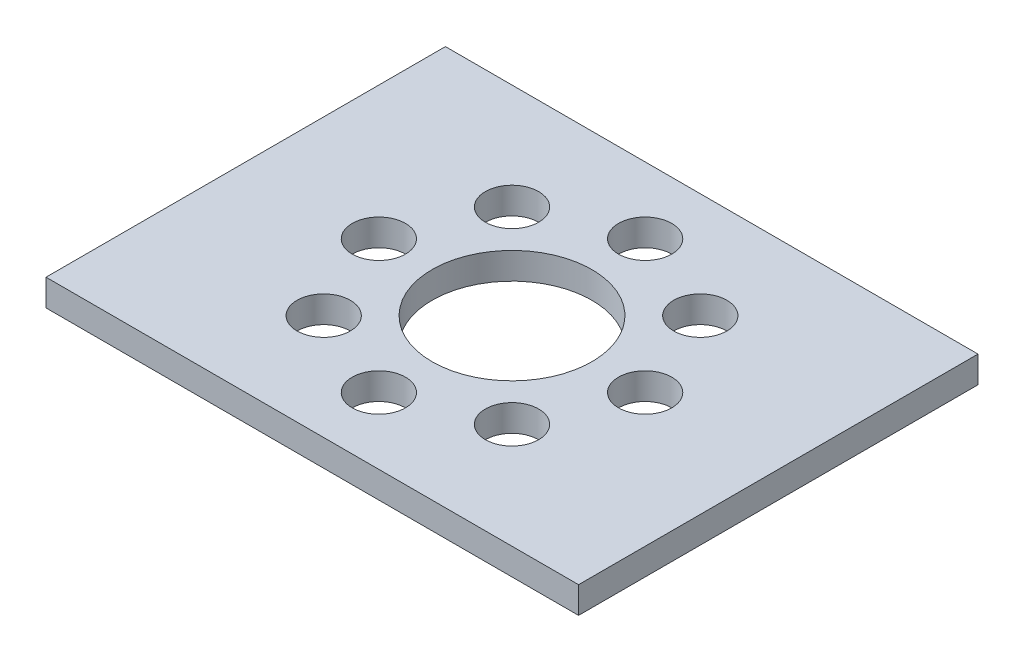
ISO-10303-21;
HEADER;
FILE_DESCRIPTION(('STEP AP214'),'2;1');
FILE_NAME('part.step','',(''),(''),'','','');
FILE_SCHEMA(('AUTOMOTIVE_DESIGN { 1 0 10303 214 1 1 1 1 }'));
ENDSEC;
DATA;
#1=APPLICATION_CONTEXT('core data for automotive mechanical design processes');
#2=APPLICATION_PROTOCOL_DEFINITION('international standard','automotive_design',2000,#1);
#3=PRODUCT_CONTEXT('',#1,'mechanical');
#4=PRODUCT('Part','Part','',(#3));
#5=PRODUCT_RELATED_PRODUCT_CATEGORY('part','',(#4));
#6=PRODUCT_DEFINITION_FORMATION('','',#4);
#7=PRODUCT_DEFINITION_CONTEXT('part definition',#1,'design');
#8=PRODUCT_DEFINITION('design','',#6,#7);
#9=PRODUCT_DEFINITION_SHAPE('','',#8);
#10=(LENGTH_UNIT() NAMED_UNIT(*) SI_UNIT(.MILLI.,.METRE.));
#11=(NAMED_UNIT(*) PLANE_ANGLE_UNIT() SI_UNIT($,.RADIAN.));
#12=(NAMED_UNIT(*) SI_UNIT($,.STERADIAN.) SOLID_ANGLE_UNIT());
#13=UNCERTAINTY_MEASURE_WITH_UNIT(LENGTH_MEASURE(1.E-05),#10,'distance_accuracy_value','');
#14=(GEOMETRIC_REPRESENTATION_CONTEXT(3) GLOBAL_UNCERTAINTY_ASSIGNED_CONTEXT((#13)) GLOBAL_UNIT_ASSIGNED_CONTEXT((#10,
#11,#12)) REPRESENTATION_CONTEXT('',''));
#15=CARTESIAN_POINT('',(0.,0.,0.));
#16=DIRECTION('',(0.,0.,1.));
#17=DIRECTION('',(1.,0.,0.));
#18=AXIS2_PLACEMENT_3D('',#15,#16,#17);
#19=CARTESIAN_POINT('',(0.,10.,0.));
#20=DIRECTION('',(0.,-1.,0.));
#21=DIRECTION('',(0.,0.,-1.));
#22=AXIS2_PLACEMENT_3D('',#19,#20,#21);
#23=PLANE('',#22);
#24=CARTESIAN_POINT('',(-35.3553390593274,10.,-35.3553390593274));
#25=DIRECTION('',(0.,1.,0.));
#26=DIRECTION('',(0.,0.,1.));
#27=AXIS2_PLACEMENT_3D('',#24,#25,#26);
#28=CIRCLE('',#27,10.0000000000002);
#29=CARTESIAN_POINT('',(-35.3553390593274,10.,-25.3553390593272));
#30=VERTEX_POINT('',#29);
#31=EDGE_CURVE('E159',#30,#30,#28,.T.);
#32=ORIENTED_EDGE('',*,*,#31,.F.);
#33=EDGE_LOOP('',(#32));
#34=FACE_BOUND('',#33,.T.);
#35=CARTESIAN_POINT('',(-50.,10.,0.));
#36=DIRECTION('',(0.,1.,0.));
#37=DIRECTION('',(0.,0.,1.));
#38=AXIS2_PLACEMENT_3D('',#35,#36,#37);
#39=CIRCLE('',#38,9.99999999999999);
#40=CARTESIAN_POINT('',(-50.,10.,10.));
#41=VERTEX_POINT('',#40);
#42=EDGE_CURVE('E153',#41,#41,#39,.T.);
#43=ORIENTED_EDGE('',*,*,#42,.F.);
#44=EDGE_LOOP('',(#43));
#45=FACE_BOUND('',#44,.T.);
#46=CARTESIAN_POINT('',(-35.3553390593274,10.,35.3553390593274));
#47=DIRECTION('',(0.,1.,0.));
#48=DIRECTION('',(0.,0.,1.));
#49=AXIS2_PLACEMENT_3D('',#46,#47,#48);
#50=CIRCLE('',#49,10.);
#51=CARTESIAN_POINT('',(-35.3553390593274,10.,45.3553390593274));
#52=VERTEX_POINT('',#51);
#53=EDGE_CURVE('E147',#52,#52,#50,.T.);
#54=ORIENTED_EDGE('',*,*,#53,.F.);
#55=EDGE_LOOP('',(#54));
#56=FACE_BOUND('',#55,.T.);
#57=CARTESIAN_POINT('',(0.,10.,50.));
#58=DIRECTION('',(0.,1.,0.));
#59=DIRECTION('',(0.,0.,1.));
#60=AXIS2_PLACEMENT_3D('',#57,#58,#59);
#61=CIRCLE('',#60,10.);
#62=CARTESIAN_POINT('',(0.,10.,60.));
#63=VERTEX_POINT('',#62);
#64=EDGE_CURVE('E141',#63,#63,#61,.T.);
#65=ORIENTED_EDGE('',*,*,#64,.F.);
#66=EDGE_LOOP('',(#65));
#67=FACE_BOUND('',#66,.T.);
#68=CARTESIAN_POINT('',(35.3553390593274,10.,35.3553390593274));
#69=DIRECTION('',(0.,1.,0.));
#70=DIRECTION('',(0.,0.,1.));
#71=AXIS2_PLACEMENT_3D('',#68,#69,#70);
#72=CIRCLE('',#71,9.99999999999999);
#73=CARTESIAN_POINT('',(35.3553390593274,10.,45.3553390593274));
#74=VERTEX_POINT('',#73);
#75=EDGE_CURVE('E135',#74,#74,#72,.T.);
#76=ORIENTED_EDGE('',*,*,#75,.F.);
#77=EDGE_LOOP('',(#76));
#78=FACE_BOUND('',#77,.T.);
#79=CARTESIAN_POINT('',(50.,10.,0.));
#80=DIRECTION('',(0.,1.,0.));
#81=DIRECTION('',(0.,0.,1.));
#82=AXIS2_PLACEMENT_3D('',#79,#80,#81);
#83=CIRCLE('',#82,10.);
#84=CARTESIAN_POINT('',(50.,10.,10.));
#85=VERTEX_POINT('',#84);
#86=EDGE_CURVE('E129',#85,#85,#83,.T.);
#87=ORIENTED_EDGE('',*,*,#86,.F.);
#88=EDGE_LOOP('',(#87));
#89=FACE_BOUND('',#88,.T.);
#90=CARTESIAN_POINT('',(35.3553390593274,10.,-35.3553390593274));
#91=DIRECTION('',(0.,1.,0.));
#92=DIRECTION('',(0.,0.,1.));
#93=AXIS2_PLACEMENT_3D('',#90,#91,#92);
#94=CIRCLE('',#93,10.0000000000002);
#95=CARTESIAN_POINT('',(35.3553390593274,10.,-25.3553390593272));
#96=VERTEX_POINT('',#95);
#97=EDGE_CURVE('E123',#96,#96,#94,.T.);
#98=ORIENTED_EDGE('',*,*,#97,.F.);
#99=EDGE_LOOP('',(#98));
#100=FACE_BOUND('',#99,.T.);
#101=CARTESIAN_POINT('',(0.,10.,-50.));
#102=DIRECTION('',(0.,1.,0.));
#103=DIRECTION('',(0.,0.,1.));
#104=AXIS2_PLACEMENT_3D('',#101,#102,#103);
#105=CIRCLE('',#104,10.);
#106=CARTESIAN_POINT('',(0.,10.,-40.));
#107=VERTEX_POINT('',#106);
#108=EDGE_CURVE('E117',#107,#107,#105,.T.);
#109=ORIENTED_EDGE('',*,*,#108,.F.);
#110=EDGE_LOOP('',(#109));
#111=FACE_BOUND('',#110,.T.);
#112=DIRECTION('',(0.,0.,-1.));
#113=VECTOR('',#112,1.);
#114=CARTESIAN_POINT('',(100.,10.,75.));
#115=LINE('',#114,#113);
#116=CARTESIAN_POINT('',(100.,10.,75.));
#117=VERTEX_POINT('',#116);
#118=CARTESIAN_POINT('',(100.,10.,-75.));
#119=VERTEX_POINT('',#118);
#120=EDGE_CURVE('E84',#117,#119,#115,.T.);
#121=ORIENTED_EDGE('',*,*,#120,.T.);
#122=DIRECTION('',(-1.,0.,0.));
#123=VECTOR('',#122,1.);
#124=CARTESIAN_POINT('',(-100.,10.,-75.));
#125=LINE('',#124,#123);
#126=CARTESIAN_POINT('',(-100.,10.,-75.));
#127=VERTEX_POINT('',#126);
#128=EDGE_CURVE('E79',#119,#127,#125,.T.);
#129=ORIENTED_EDGE('',*,*,#128,.T.);
#130=DIRECTION('',(0.,0.,1.));
#131=VECTOR('',#130,1.);
#132=CARTESIAN_POINT('',(-100.,10.,75.));
#133=LINE('',#132,#131);
#134=CARTESIAN_POINT('',(-100.,10.,75.));
#135=VERTEX_POINT('',#134);
#136=EDGE_CURVE('E82',#127,#135,#133,.T.);
#137=ORIENTED_EDGE('',*,*,#136,.T.);
#138=DIRECTION('',(1.,0.,0.));
#139=VECTOR('',#138,1.);
#140=CARTESIAN_POINT('',(-100.,10.,75.));
#141=LINE('',#140,#139);
#142=EDGE_CURVE('E49',#135,#117,#141,.T.);
#143=ORIENTED_EDGE('',*,*,#142,.T.);
#144=EDGE_LOOP('',(#121,#129,#137,#143));
#145=FACE_BOUND('',#144,.T.);
#146=CARTESIAN_POINT('',(0.,10.,0.));
#147=DIRECTION('',(0.,1.,0.));
#148=DIRECTION('',(0.,0.,1.));
#149=AXIS2_PLACEMENT_3D('',#146,#147,#148);
#150=CIRCLE('',#149,30.);
#151=CARTESIAN_POINT('',(0.,10.,30.));
#152=VERTEX_POINT('',#151);
#153=EDGE_CURVE('E99',#152,#152,#150,.T.);
#154=ORIENTED_EDGE('',*,*,#153,.F.);
#155=EDGE_LOOP('',(#154));
#156=FACE_BOUND('',#155,.T.);
#157=ADVANCED_FACE('F32',(#34,#45,#56,#67,#78,#89,#100,#111,#145,#156),#23,.F.);
#158=CARTESIAN_POINT('',(0.,0.,0.));
#159=DIRECTION('',(0.,-1.,0.));
#160=DIRECTION('',(0.,0.,-1.));
#161=AXIS2_PLACEMENT_3D('',#158,#159,#160);
#162=PLANE('',#161);
#163=CARTESIAN_POINT('',(-35.3553390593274,0.,-35.3553390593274));
#164=DIRECTION('',(0.,1.,0.));
#165=DIRECTION('',(0.,0.,1.));
#166=AXIS2_PLACEMENT_3D('',#163,#164,#165);
#167=CIRCLE('',#166,10.0000000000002);
#168=CARTESIAN_POINT('',(-35.3553390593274,0.,-25.3553390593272));
#169=VERTEX_POINT('',#168);
#170=EDGE_CURVE('E156',#169,#169,#167,.T.);
#171=ORIENTED_EDGE('',*,*,#170,.T.);
#172=EDGE_LOOP('',(#171));
#173=FACE_BOUND('',#172,.T.);
#174=CARTESIAN_POINT('',(-50.,0.,0.));
#175=DIRECTION('',(0.,1.,0.));
#176=DIRECTION('',(0.,0.,1.));
#177=AXIS2_PLACEMENT_3D('',#174,#175,#176);
#178=CIRCLE('',#177,9.99999999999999);
#179=CARTESIAN_POINT('',(-50.,0.,10.));
#180=VERTEX_POINT('',#179);
#181=EDGE_CURVE('E150',#180,#180,#178,.T.);
#182=ORIENTED_EDGE('',*,*,#181,.T.);
#183=EDGE_LOOP('',(#182));
#184=FACE_BOUND('',#183,.T.);
#185=CARTESIAN_POINT('',(-35.3553390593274,0.,35.3553390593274));
#186=DIRECTION('',(0.,1.,0.));
#187=DIRECTION('',(0.,0.,1.));
#188=AXIS2_PLACEMENT_3D('',#185,#186,#187);
#189=CIRCLE('',#188,10.);
#190=CARTESIAN_POINT('',(-35.3553390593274,0.,45.3553390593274));
#191=VERTEX_POINT('',#190);
#192=EDGE_CURVE('E144',#191,#191,#189,.T.);
#193=ORIENTED_EDGE('',*,*,#192,.T.);
#194=EDGE_LOOP('',(#193));
#195=FACE_BOUND('',#194,.T.);
#196=CARTESIAN_POINT('',(0.,0.,50.));
#197=DIRECTION('',(0.,1.,0.));
#198=DIRECTION('',(0.,0.,1.));
#199=AXIS2_PLACEMENT_3D('',#196,#197,#198);
#200=CIRCLE('',#199,10.);
#201=CARTESIAN_POINT('',(0.,0.,60.));
#202=VERTEX_POINT('',#201);
#203=EDGE_CURVE('E138',#202,#202,#200,.T.);
#204=ORIENTED_EDGE('',*,*,#203,.T.);
#205=EDGE_LOOP('',(#204));
#206=FACE_BOUND('',#205,.T.);
#207=CARTESIAN_POINT('',(35.3553390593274,0.,35.3553390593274));
#208=DIRECTION('',(0.,1.,0.));
#209=DIRECTION('',(0.,0.,1.));
#210=AXIS2_PLACEMENT_3D('',#207,#208,#209);
#211=CIRCLE('',#210,9.99999999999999);
#212=CARTESIAN_POINT('',(35.3553390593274,0.,45.3553390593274));
#213=VERTEX_POINT('',#212);
#214=EDGE_CURVE('E132',#213,#213,#211,.T.);
#215=ORIENTED_EDGE('',*,*,#214,.T.);
#216=EDGE_LOOP('',(#215));
#217=FACE_BOUND('',#216,.T.);
#218=CARTESIAN_POINT('',(50.,0.,0.));
#219=DIRECTION('',(0.,1.,0.));
#220=DIRECTION('',(0.,0.,1.));
#221=AXIS2_PLACEMENT_3D('',#218,#219,#220);
#222=CIRCLE('',#221,10.);
#223=CARTESIAN_POINT('',(50.,0.,10.));
#224=VERTEX_POINT('',#223);
#225=EDGE_CURVE('E126',#224,#224,#222,.T.);
#226=ORIENTED_EDGE('',*,*,#225,.T.);
#227=EDGE_LOOP('',(#226));
#228=FACE_BOUND('',#227,.T.);
#229=CARTESIAN_POINT('',(35.3553390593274,0.,-35.3553390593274));
#230=DIRECTION('',(0.,1.,0.));
#231=DIRECTION('',(0.,0.,1.));
#232=AXIS2_PLACEMENT_3D('',#229,#230,#231);
#233=CIRCLE('',#232,10.0000000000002);
#234=CARTESIAN_POINT('',(35.3553390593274,0.,-25.3553390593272));
#235=VERTEX_POINT('',#234);
#236=EDGE_CURVE('E120',#235,#235,#233,.T.);
#237=ORIENTED_EDGE('',*,*,#236,.T.);
#238=EDGE_LOOP('',(#237));
#239=FACE_BOUND('',#238,.T.);
#240=CARTESIAN_POINT('',(0.,0.,-50.));
#241=DIRECTION('',(0.,1.,0.));
#242=DIRECTION('',(0.,0.,1.));
#243=AXIS2_PLACEMENT_3D('',#240,#241,#242);
#244=CIRCLE('',#243,10.);
#245=CARTESIAN_POINT('',(0.,0.,-40.));
#246=VERTEX_POINT('',#245);
#247=EDGE_CURVE('E114',#246,#246,#244,.T.);
#248=ORIENTED_EDGE('',*,*,#247,.T.);
#249=EDGE_LOOP('',(#248));
#250=FACE_BOUND('',#249,.T.);
#251=DIRECTION('',(0.,0.,-1.));
#252=VECTOR('',#251,1.);
#253=CARTESIAN_POINT('',(100.,0.,75.));
#254=LINE('',#253,#252);
#255=CARTESIAN_POINT('',(100.,0.,75.));
#256=VERTEX_POINT('',#255);
#257=CARTESIAN_POINT('',(100.,0.,-75.));
#258=VERTEX_POINT('',#257);
#259=EDGE_CURVE('E96',#256,#258,#254,.T.);
#260=ORIENTED_EDGE('',*,*,#259,.F.);
#261=DIRECTION('',(1.,0.,0.));
#262=VECTOR('',#261,1.);
#263=CARTESIAN_POINT('',(-100.,0.,75.));
#264=LINE('',#263,#262);
#265=CARTESIAN_POINT('',(-100.,0.,75.));
#266=VERTEX_POINT('',#265);
#267=EDGE_CURVE('E72',#266,#256,#264,.T.);
#268=ORIENTED_EDGE('',*,*,#267,.F.);
#269=DIRECTION('',(0.,0.,1.));
#270=VECTOR('',#269,1.);
#271=CARTESIAN_POINT('',(-100.,0.,75.));
#272=LINE('',#271,#270);
#273=CARTESIAN_POINT('',(-100.,0.,-75.));
#274=VERTEX_POINT('',#273);
#275=EDGE_CURVE('E66',#274,#266,#272,.T.);
#276=ORIENTED_EDGE('',*,*,#275,.F.);
#277=DIRECTION('',(-1.,0.,0.));
#278=VECTOR('',#277,1.);
#279=CARTESIAN_POINT('',(-100.,0.,-75.));
#280=LINE('',#279,#278);
#281=EDGE_CURVE('E88',#258,#274,#280,.T.);
#282=ORIENTED_EDGE('',*,*,#281,.F.);
#283=EDGE_LOOP('',(#260,#268,#276,#282));
#284=FACE_BOUND('',#283,.T.);
#285=CARTESIAN_POINT('',(0.,0.,0.));
#286=DIRECTION('',(0.,1.,0.));
#287=DIRECTION('',(0.,0.,1.));
#288=AXIS2_PLACEMENT_3D('',#285,#286,#287);
#289=CIRCLE('',#288,30.);
#290=CARTESIAN_POINT('',(0.,0.,30.));
#291=VERTEX_POINT('',#290);
#292=EDGE_CURVE('E111',#291,#291,#289,.T.);
#293=ORIENTED_EDGE('',*,*,#292,.T.);
#294=EDGE_LOOP('',(#293));
#295=FACE_BOUND('',#294,.T.);
#296=ADVANCED_FACE('F107',(#173,#184,#195,#206,#217,#228,#239,#250,#284,#295),#162,.T.);
#297=CARTESIAN_POINT('',(100.,10.,75.));
#298=DIRECTION('',(-1.,0.,0.));
#299=DIRECTION('',(0.,0.,1.));
#300=AXIS2_PLACEMENT_3D('',#297,#298,#299);
#301=PLANE('',#300);
#302=ORIENTED_EDGE('',*,*,#259,.T.);
#303=DIRECTION('',(0.,-1.,0.));
#304=VECTOR('',#303,1.);
#305=CARTESIAN_POINT('',(100.,10.,-75.));
#306=LINE('',#305,#304);
#307=EDGE_CURVE('E11',#119,#258,#306,.T.);
#308=ORIENTED_EDGE('',*,*,#307,.F.);
#309=ORIENTED_EDGE('',*,*,#120,.F.);
#310=DIRECTION('',(0.,-1.,0.));
#311=VECTOR('',#310,1.);
#312=CARTESIAN_POINT('',(100.,10.,75.));
#313=LINE('',#312,#311);
#314=EDGE_CURVE('E92',#117,#256,#313,.T.);
#315=ORIENTED_EDGE('',*,*,#314,.T.);
#316=EDGE_LOOP('',(#302,#308,#309,#315));
#317=FACE_BOUND('',#316,.T.);
#318=ADVANCED_FACE('F34',(#317),#301,.F.);
#319=CARTESIAN_POINT('',(-100.,10.,-75.));
#320=DIRECTION('',(0.,0.,1.));
#321=DIRECTION('',(1.,0.,0.));
#322=AXIS2_PLACEMENT_3D('',#319,#320,#321);
#323=PLANE('',#322);
#324=ORIENTED_EDGE('',*,*,#281,.T.);
#325=DIRECTION('',(0.,-1.,0.));
#326=VECTOR('',#325,1.);
#327=CARTESIAN_POINT('',(-100.,10.,-75.));
#328=LINE('',#327,#326);
#329=EDGE_CURVE('E41',#127,#274,#328,.T.);
#330=ORIENTED_EDGE('',*,*,#329,.F.);
#331=ORIENTED_EDGE('',*,*,#128,.F.);
#332=ORIENTED_EDGE('',*,*,#307,.T.);
#333=EDGE_LOOP('',(#324,#330,#331,#332));
#334=FACE_BOUND('',#333,.T.);
#335=ADVANCED_FACE('F87',(#334),#323,.F.);
#336=CARTESIAN_POINT('',(-100.,10.,75.));
#337=DIRECTION('',(1.,0.,0.));
#338=DIRECTION('',(0.,0.,-1.));
#339=AXIS2_PLACEMENT_3D('',#336,#337,#338);
#340=PLANE('',#339);
#341=ORIENTED_EDGE('',*,*,#275,.T.);
#342=DIRECTION('',(0.,-1.,0.));
#343=VECTOR('',#342,1.);
#344=CARTESIAN_POINT('',(-100.,10.,75.));
#345=LINE('',#344,#343);
#346=EDGE_CURVE('E89',#135,#266,#345,.T.);
#347=ORIENTED_EDGE('',*,*,#346,.F.);
#348=ORIENTED_EDGE('',*,*,#136,.F.);
#349=ORIENTED_EDGE('',*,*,#329,.T.);
#350=EDGE_LOOP('',(#341,#347,#348,#349));
#351=FACE_BOUND('',#350,.T.);
#352=ADVANCED_FACE('F90',(#351),#340,.F.);
#353=CARTESIAN_POINT('',(-100.,10.,75.));
#354=DIRECTION('',(0.,0.,-1.));
#355=DIRECTION('',(-1.,0.,0.));
#356=AXIS2_PLACEMENT_3D('',#353,#354,#355);
#357=PLANE('',#356);
#358=ORIENTED_EDGE('',*,*,#267,.T.);
#359=ORIENTED_EDGE('',*,*,#314,.F.);
#360=ORIENTED_EDGE('',*,*,#142,.F.);
#361=ORIENTED_EDGE('',*,*,#346,.T.);
#362=EDGE_LOOP('',(#358,#359,#360,#361));
#363=FACE_BOUND('',#362,.T.);
#364=ADVANCED_FACE('F104',(#363),#357,.F.);
#365=CARTESIAN_POINT('',(0.,10.,0.));
#366=DIRECTION('',(0.,-1.,0.));
#367=DIRECTION('',(0.,0.,-1.));
#368=AXIS2_PLACEMENT_3D('',#365,#366,#367);
#369=CYLINDRICAL_SURFACE('',#368,30.);
#370=ORIENTED_EDGE('',*,*,#153,.T.);
#371=EDGE_LOOP('',(#370));
#372=FACE_BOUND('',#371,.T.);
#373=ORIENTED_EDGE('',*,*,#292,.F.);
#374=EDGE_LOOP('',(#373));
#375=FACE_BOUND('',#374,.T.);
#376=ADVANCED_FACE('F194',(#372,#375),#369,.F.);
#377=CARTESIAN_POINT('',(0.,0.,-50.));
#378=DIRECTION('',(0.,1.,0.));
#379=DIRECTION('',(0.,0.,1.));
#380=AXIS2_PLACEMENT_3D('',#377,#378,#379);
#381=CYLINDRICAL_SURFACE('',#380,10.);
#382=ORIENTED_EDGE('',*,*,#247,.F.);
#383=EDGE_LOOP('',(#382));
#384=FACE_BOUND('',#383,.T.);
#385=ORIENTED_EDGE('',*,*,#108,.T.);
#386=EDGE_LOOP('',(#385));
#387=FACE_BOUND('',#386,.T.);
#388=ADVANCED_FACE('F191',(#384,#387),#381,.F.);
#389=CARTESIAN_POINT('',(35.3553390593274,0.,-35.3553390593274));
#390=DIRECTION('',(0.,1.,0.));
#391=DIRECTION('',(0.,0.,1.));
#392=AXIS2_PLACEMENT_3D('',#389,#390,#391);
#393=CYLINDRICAL_SURFACE('',#392,10.0000000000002);
#394=ORIENTED_EDGE('',*,*,#236,.F.);
#395=EDGE_LOOP('',(#394));
#396=FACE_BOUND('',#395,.T.);
#397=ORIENTED_EDGE('',*,*,#97,.T.);
#398=EDGE_LOOP('',(#397));
#399=FACE_BOUND('',#398,.T.);
#400=ADVANCED_FACE('F193',(#396,#399),#393,.F.);
#401=CARTESIAN_POINT('',(50.,0.,0.));
#402=DIRECTION('',(0.,1.,0.));
#403=DIRECTION('',(0.,0.,1.));
#404=AXIS2_PLACEMENT_3D('',#401,#402,#403);
#405=CYLINDRICAL_SURFACE('',#404,10.);
#406=ORIENTED_EDGE('',*,*,#225,.F.);
#407=EDGE_LOOP('',(#406));
#408=FACE_BOUND('',#407,.T.);
#409=ORIENTED_EDGE('',*,*,#86,.T.);
#410=EDGE_LOOP('',(#409));
#411=FACE_BOUND('',#410,.T.);
#412=ADVANCED_FACE('F201',(#408,#411),#405,.F.);
#413=CARTESIAN_POINT('',(35.3553390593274,0.,35.3553390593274));
#414=DIRECTION('',(0.,1.,0.));
#415=DIRECTION('',(0.,0.,1.));
#416=AXIS2_PLACEMENT_3D('',#413,#414,#415);
#417=CYLINDRICAL_SURFACE('',#416,9.99999999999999);
#418=ORIENTED_EDGE('',*,*,#214,.F.);
#419=EDGE_LOOP('',(#418));
#420=FACE_BOUND('',#419,.T.);
#421=ORIENTED_EDGE('',*,*,#75,.T.);
#422=EDGE_LOOP('',(#421));
#423=FACE_BOUND('',#422,.T.);
#424=ADVANCED_FACE('F273',(#420,#423),#417,.F.);
#425=CARTESIAN_POINT('',(0.,0.,50.));
#426=DIRECTION('',(0.,1.,0.));
#427=DIRECTION('',(0.,0.,1.));
#428=AXIS2_PLACEMENT_3D('',#425,#426,#427);
#429=CYLINDRICAL_SURFACE('',#428,10.);
#430=ORIENTED_EDGE('',*,*,#203,.F.);
#431=EDGE_LOOP('',(#430));
#432=FACE_BOUND('',#431,.T.);
#433=ORIENTED_EDGE('',*,*,#64,.T.);
#434=EDGE_LOOP('',(#433));
#435=FACE_BOUND('',#434,.T.);
#436=ADVANCED_FACE('F281',(#432,#435),#429,.F.);
#437=CARTESIAN_POINT('',(-35.3553390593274,0.,35.3553390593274));
#438=DIRECTION('',(0.,1.,0.));
#439=DIRECTION('',(0.,0.,1.));
#440=AXIS2_PLACEMENT_3D('',#437,#438,#439);
#441=CYLINDRICAL_SURFACE('',#440,10.);
#442=ORIENTED_EDGE('',*,*,#192,.F.);
#443=EDGE_LOOP('',(#442));
#444=FACE_BOUND('',#443,.T.);
#445=ORIENTED_EDGE('',*,*,#53,.T.);
#446=EDGE_LOOP('',(#445));
#447=FACE_BOUND('',#446,.T.);
#448=ADVANCED_FACE('F290',(#444,#447),#441,.F.);
#449=CARTESIAN_POINT('',(-50.,0.,0.));
#450=DIRECTION('',(0.,1.,0.));
#451=DIRECTION('',(0.,0.,1.));
#452=AXIS2_PLACEMENT_3D('',#449,#450,#451);
#453=CYLINDRICAL_SURFACE('',#452,9.99999999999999);
#454=ORIENTED_EDGE('',*,*,#181,.F.);
#455=EDGE_LOOP('',(#454));
#456=FACE_BOUND('',#455,.T.);
#457=ORIENTED_EDGE('',*,*,#42,.T.);
#458=EDGE_LOOP('',(#457));
#459=FACE_BOUND('',#458,.T.);
#460=ADVANCED_FACE('F170',(#456,#459),#453,.F.);
#461=CARTESIAN_POINT('',(-35.3553390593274,0.,-35.3553390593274));
#462=DIRECTION('',(0.,1.,0.));
#463=DIRECTION('',(0.,0.,1.));
#464=AXIS2_PLACEMENT_3D('',#461,#462,#463);
#465=CYLINDRICAL_SURFACE('',#464,10.0000000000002);
#466=ORIENTED_EDGE('',*,*,#170,.F.);
#467=EDGE_LOOP('',(#466));
#468=FACE_BOUND('',#467,.T.);
#469=ORIENTED_EDGE('',*,*,#31,.T.);
#470=EDGE_LOOP('',(#469));
#471=FACE_BOUND('',#470,.T.);
#472=ADVANCED_FACE('F167',(#468,#471),#465,.F.);
#473=CLOSED_SHELL('',(#157,#296,#318,#335,#352,#364,#376,#388,#400,#412,#424,#436,#448,#460,#472));
#474=MANIFOLD_SOLID_BREP('B2',#473);
#475=ADVANCED_BREP_SHAPE_REPRESENTATION('',(#18,#474),#14);
#476=SHAPE_DEFINITION_REPRESENTATION(#9,#475);
ENDSEC;
END-ISO-10303-21;
